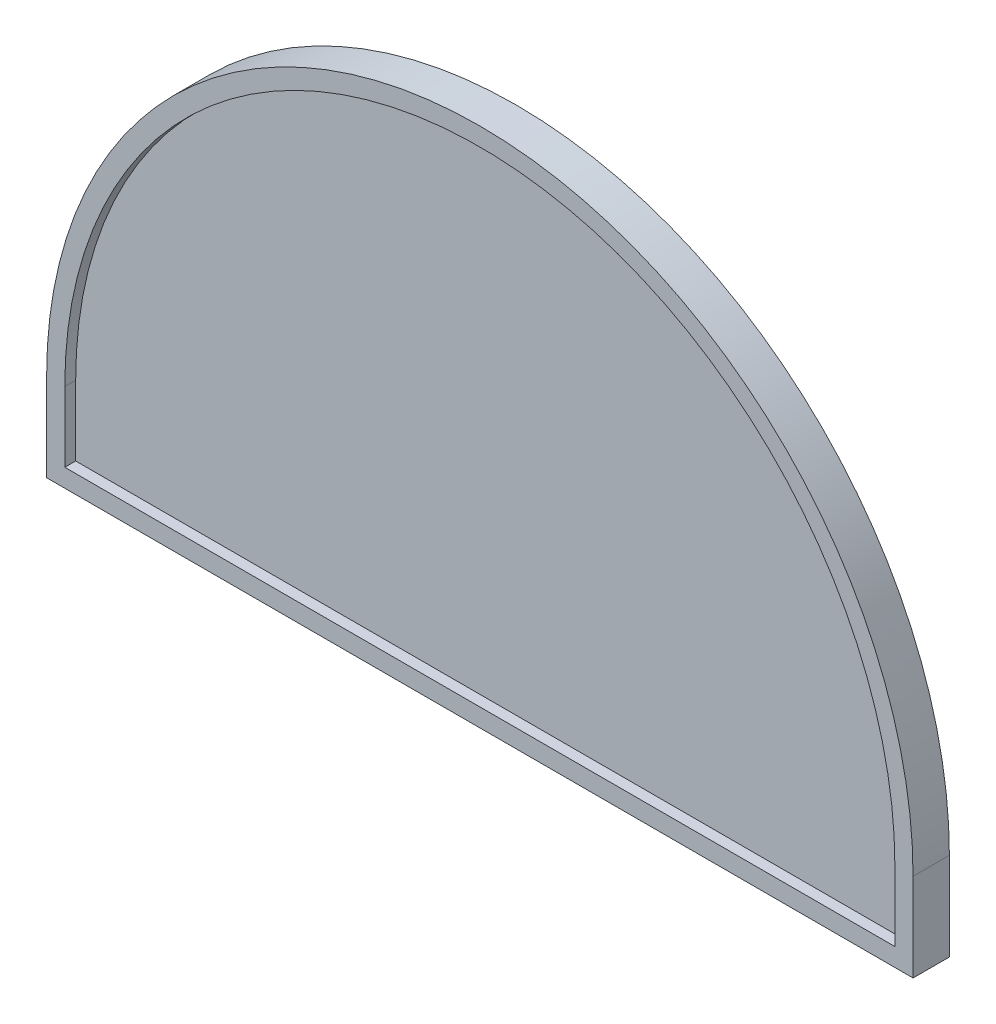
ISO-10303-21;
HEADER;
FILE_DESCRIPTION(('STEP AP214'),'2;1');
FILE_NAME('part.step','',(''),(''),'','','');
FILE_SCHEMA(('AUTOMOTIVE_DESIGN { 1 0 10303 214 1 1 1 1 }'));
ENDSEC;
DATA;
#1=APPLICATION_CONTEXT('core data for automotive mechanical design processes');
#2=APPLICATION_PROTOCOL_DEFINITION('international standard','automotive_design',2000,#1);
#3=PRODUCT_CONTEXT('',#1,'mechanical');
#4=PRODUCT('Part','Part','',(#3));
#5=PRODUCT_RELATED_PRODUCT_CATEGORY('part','',(#4));
#6=PRODUCT_DEFINITION_FORMATION('','',#4);
#7=PRODUCT_DEFINITION_CONTEXT('part definition',#1,'design');
#8=PRODUCT_DEFINITION('design','',#6,#7);
#9=PRODUCT_DEFINITION_SHAPE('','',#8);
#10=(LENGTH_UNIT() NAMED_UNIT(*) SI_UNIT(.MILLI.,.METRE.));
#11=(NAMED_UNIT(*) PLANE_ANGLE_UNIT() SI_UNIT($,.RADIAN.));
#12=(NAMED_UNIT(*) SI_UNIT($,.STERADIAN.) SOLID_ANGLE_UNIT());
#13=UNCERTAINTY_MEASURE_WITH_UNIT(LENGTH_MEASURE(1.E-05),#10,'distance_accuracy_value','');
#14=(GEOMETRIC_REPRESENTATION_CONTEXT(3) GLOBAL_UNCERTAINTY_ASSIGNED_CONTEXT((#13)) GLOBAL_UNIT_ASSIGNED_CONTEXT((#10,
#11,#12)) REPRESENTATION_CONTEXT('',''));
#15=CARTESIAN_POINT('',(0.,0.,0.));
#16=DIRECTION('',(0.,0.,1.));
#17=DIRECTION('',(1.,0.,0.));
#18=AXIS2_PLACEMENT_3D('',#15,#16,#17);
#19=CARTESIAN_POINT('',(0.,0.,2.8));
#20=DIRECTION('',(0.,0.,1.));
#21=DIRECTION('',(1.,0.,0.));
#22=AXIS2_PLACEMENT_3D('',#19,#20,#21);
#23=PLANE('',#22);
#24=DIRECTION('',(0.,-1.,0.));
#25=VECTOR('',#24,1.);
#26=CARTESIAN_POINT('',(45.7,0.,2.8));
#27=LINE('',#26,#25);
#28=CARTESIAN_POINT('',(45.7,0.,2.8));
#29=VERTEX_POINT('',#28);
#30=CARTESIAN_POINT('',(45.7,-7.70000000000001,2.8));
#31=VERTEX_POINT('',#30);
#32=EDGE_CURVE('E156',#29,#31,#27,.T.);
#33=ORIENTED_EDGE('',*,*,#32,.F.);
#34=CARTESIAN_POINT('',(0.,0.,2.8));
#35=DIRECTION('',(0.,0.,1.));
#36=DIRECTION('',(1.,0.,0.));
#37=AXIS2_PLACEMENT_3D('',#34,#35,#36);
#38=CIRCLE('',#37,45.7);
#39=CARTESIAN_POINT('',(-45.7,0.,2.8));
#40=VERTEX_POINT('',#39);
#41=EDGE_CURVE('E11',#29,#40,#38,.T.);
#42=ORIENTED_EDGE('',*,*,#41,.T.);
#43=DIRECTION('',(0.,-1.,0.));
#44=VECTOR('',#43,1.);
#45=CARTESIAN_POINT('',(-45.7,0.,2.8));
#46=LINE('',#45,#44);
#47=CARTESIAN_POINT('',(-45.7,-7.70000000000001,2.8));
#48=VERTEX_POINT('',#47);
#49=EDGE_CURVE('E41',#40,#48,#46,.T.);
#50=ORIENTED_EDGE('',*,*,#49,.T.);
#51=DIRECTION('',(-1.,0.,0.));
#52=VECTOR('',#51,1.);
#53=CARTESIAN_POINT('',(45.7,-7.70000000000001,2.8));
#54=LINE('',#53,#52);
#55=EDGE_CURVE('E56',#31,#48,#54,.T.);
#56=ORIENTED_EDGE('',*,*,#55,.F.);
#57=EDGE_LOOP('',(#33,#42,#50,#56));
#58=FACE_BOUND('',#57,.T.);
#59=ADVANCED_FACE('F33',(#58),#23,.T.);
#60=CARTESIAN_POINT('',(0.,0.,4.));
#61=DIRECTION('',(0.,0.,1.));
#62=DIRECTION('',(1.,0.,0.));
#63=AXIS2_PLACEMENT_3D('',#60,#61,#62);
#64=PLANE('',#63);
#65=CARTESIAN_POINT('',(0.,0.,4.));
#66=DIRECTION('',(0.,0.,1.));
#67=DIRECTION('',(1.,0.,0.));
#68=AXIS2_PLACEMENT_3D('',#65,#66,#67);
#69=CIRCLE('',#68,47.7);
#70=CARTESIAN_POINT('',(47.7,0.,4.));
#71=VERTEX_POINT('',#70);
#72=CARTESIAN_POINT('',(-47.7,0.,4.));
#73=VERTEX_POINT('',#72);
#74=EDGE_CURVE('E127',#71,#73,#69,.T.);
#75=ORIENTED_EDGE('',*,*,#74,.T.);
#76=DIRECTION('',(0.,-1.,0.));
#77=VECTOR('',#76,1.);
#78=CARTESIAN_POINT('',(-47.7,0.,4.));
#79=LINE('',#78,#77);
#80=CARTESIAN_POINT('',(-47.7,-9.70000000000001,4.));
#81=VERTEX_POINT('',#80);
#82=EDGE_CURVE('E130',#73,#81,#79,.T.);
#83=ORIENTED_EDGE('',*,*,#82,.T.);
#84=DIRECTION('',(1.,0.,0.));
#85=VECTOR('',#84,1.);
#86=CARTESIAN_POINT('',(47.7,-9.7,4.));
#87=LINE('',#86,#85);
#88=CARTESIAN_POINT('',(47.7,-9.7,4.));
#89=VERTEX_POINT('',#88);
#90=EDGE_CURVE('E133',#81,#89,#87,.T.);
#91=ORIENTED_EDGE('',*,*,#90,.T.);
#92=DIRECTION('',(0.,1.,0.));
#93=VECTOR('',#92,1.);
#94=CARTESIAN_POINT('',(47.7,0.,4.));
#95=LINE('',#94,#93);
#96=EDGE_CURVE('E135',#89,#71,#95,.T.);
#97=ORIENTED_EDGE('',*,*,#96,.T.);
#98=EDGE_LOOP('',(#75,#83,#91,#97));
#99=FACE_BOUND('',#98,.T.);
#100=DIRECTION('',(1.,0.,0.));
#101=VECTOR('',#100,1.);
#102=CARTESIAN_POINT('',(45.7,-7.70000000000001,4.));
#103=LINE('',#102,#101);
#104=CARTESIAN_POINT('',(-45.7,-7.70000000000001,4.));
#105=VERTEX_POINT('',#104);
#106=CARTESIAN_POINT('',(45.7,-7.70000000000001,4.));
#107=VERTEX_POINT('',#106);
#108=EDGE_CURVE('E106',#105,#107,#103,.T.);
#109=ORIENTED_EDGE('',*,*,#108,.F.);
#110=DIRECTION('',(0.,-1.,0.));
#111=VECTOR('',#110,1.);
#112=CARTESIAN_POINT('',(-45.7,0.,4.));
#113=LINE('',#112,#111);
#114=CARTESIAN_POINT('',(-45.7,0.,4.));
#115=VERTEX_POINT('',#114);
#116=EDGE_CURVE('E99',#115,#105,#113,.T.);
#117=ORIENTED_EDGE('',*,*,#116,.F.);
#118=CARTESIAN_POINT('',(0.,0.,4.));
#119=DIRECTION('',(0.,0.,1.));
#120=DIRECTION('',(1.,0.,0.));
#121=AXIS2_PLACEMENT_3D('',#118,#119,#120);
#122=CIRCLE('',#121,45.7);
#123=CARTESIAN_POINT('',(45.7,0.,4.));
#124=VERTEX_POINT('',#123);
#125=EDGE_CURVE('E118',#124,#115,#122,.T.);
#126=ORIENTED_EDGE('',*,*,#125,.F.);
#127=DIRECTION('',(0.,1.,0.));
#128=VECTOR('',#127,1.);
#129=CARTESIAN_POINT('',(45.7,0.,4.));
#130=LINE('',#129,#128);
#131=EDGE_CURVE('E116',#107,#124,#130,.T.);
#132=ORIENTED_EDGE('',*,*,#131,.F.);
#133=EDGE_LOOP('',(#109,#117,#126,#132));
#134=FACE_BOUND('',#133,.T.);
#135=ADVANCED_FACE('F114',(#99,#134),#64,.T.);
#136=CARTESIAN_POINT('',(0.,0.,4.));
#137=DIRECTION('',(0.,0.,-1.));
#138=DIRECTION('',(-1.,0.,0.));
#139=AXIS2_PLACEMENT_3D('',#136,#137,#138);
#140=CYLINDRICAL_SURFACE('',#139,47.7);
#141=CARTESIAN_POINT('',(0.,0.,0.));
#142=DIRECTION('',(0.,0.,1.));
#143=DIRECTION('',(1.,0.,0.));
#144=AXIS2_PLACEMENT_3D('',#141,#142,#143);
#145=CIRCLE('',#144,47.7);
#146=CARTESIAN_POINT('',(47.7,0.,0.));
#147=VERTEX_POINT('',#146);
#148=CARTESIAN_POINT('',(-47.7,0.,0.));
#149=VERTEX_POINT('',#148);
#150=EDGE_CURVE('E110',#147,#149,#145,.T.);
#151=ORIENTED_EDGE('',*,*,#150,.T.);
#152=DIRECTION('',(0.,0.,-1.));
#153=VECTOR('',#152,1.);
#154=CARTESIAN_POINT('',(-47.7,0.,4.));
#155=LINE('',#154,#153);
#156=EDGE_CURVE('E153',#73,#149,#155,.T.);
#157=ORIENTED_EDGE('',*,*,#156,.F.);
#158=ORIENTED_EDGE('',*,*,#74,.F.);
#159=DIRECTION('',(0.,0.,-1.));
#160=VECTOR('',#159,1.);
#161=CARTESIAN_POINT('',(47.7,0.,4.));
#162=LINE('',#161,#160);
#163=EDGE_CURVE('E137',#71,#147,#162,.T.);
#164=ORIENTED_EDGE('',*,*,#163,.T.);
#165=EDGE_LOOP('',(#151,#157,#158,#164));
#166=FACE_BOUND('',#165,.T.);
#167=ADVANCED_FACE('F175',(#166),#140,.T.);
#168=CARTESIAN_POINT('',(-47.7,0.,4.));
#169=DIRECTION('',(1.,0.,0.));
#170=DIRECTION('',(0.,0.,-1.));
#171=AXIS2_PLACEMENT_3D('',#168,#169,#170);
#172=PLANE('',#171);
#173=DIRECTION('',(0.,-1.,0.));
#174=VECTOR('',#173,1.);
#175=CARTESIAN_POINT('',(-47.7,0.,0.));
#176=LINE('',#175,#174);
#177=CARTESIAN_POINT('',(-47.7,-9.70000000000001,0.));
#178=VERTEX_POINT('',#177);
#179=EDGE_CURVE('E140',#149,#178,#176,.T.);
#180=ORIENTED_EDGE('',*,*,#179,.T.);
#181=DIRECTION('',(0.,0.,-1.));
#182=VECTOR('',#181,1.);
#183=CARTESIAN_POINT('',(-47.7,-9.70000000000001,4.));
#184=LINE('',#183,#182);
#185=EDGE_CURVE('E150',#81,#178,#184,.T.);
#186=ORIENTED_EDGE('',*,*,#185,.F.);
#187=ORIENTED_EDGE('',*,*,#82,.F.);
#188=ORIENTED_EDGE('',*,*,#156,.T.);
#189=EDGE_LOOP('',(#180,#186,#187,#188));
#190=FACE_BOUND('',#189,.T.);
#191=ADVANCED_FACE('F181',(#190),#172,.F.);
#192=CARTESIAN_POINT('',(47.7,-9.7,4.));
#193=DIRECTION('',(0.,1.,0.));
#194=DIRECTION('',(-1.,0.,0.));
#195=AXIS2_PLACEMENT_3D('',#192,#193,#194);
#196=PLANE('',#195);
#197=DIRECTION('',(1.,0.,0.));
#198=VECTOR('',#197,1.);
#199=CARTESIAN_POINT('',(47.7,-9.7,0.));
#200=LINE('',#199,#198);
#201=CARTESIAN_POINT('',(47.7,-9.7,0.));
#202=VERTEX_POINT('',#201);
#203=EDGE_CURVE('E142',#178,#202,#200,.T.);
#204=ORIENTED_EDGE('',*,*,#203,.T.);
#205=DIRECTION('',(0.,0.,-1.));
#206=VECTOR('',#205,1.);
#207=CARTESIAN_POINT('',(47.7,-9.7,4.));
#208=LINE('',#207,#206);
#209=EDGE_CURVE('E147',#89,#202,#208,.T.);
#210=ORIENTED_EDGE('',*,*,#209,.F.);
#211=ORIENTED_EDGE('',*,*,#90,.F.);
#212=ORIENTED_EDGE('',*,*,#185,.T.);
#213=EDGE_LOOP('',(#204,#210,#211,#212));
#214=FACE_BOUND('',#213,.T.);
#215=ADVANCED_FACE('F185',(#214),#196,.F.);
#216=CARTESIAN_POINT('',(47.7,0.,4.));
#217=DIRECTION('',(-1.,0.,0.));
#218=DIRECTION('',(0.,0.,1.));
#219=AXIS2_PLACEMENT_3D('',#216,#217,#218);
#220=PLANE('',#219);
#221=DIRECTION('',(0.,1.,0.));
#222=VECTOR('',#221,1.);
#223=CARTESIAN_POINT('',(47.7,0.,0.));
#224=LINE('',#223,#222);
#225=EDGE_CURVE('E131',#202,#147,#224,.T.);
#226=ORIENTED_EDGE('',*,*,#225,.T.);
#227=ORIENTED_EDGE('',*,*,#163,.F.);
#228=ORIENTED_EDGE('',*,*,#96,.F.);
#229=ORIENTED_EDGE('',*,*,#209,.T.);
#230=EDGE_LOOP('',(#226,#227,#228,#229));
#231=FACE_BOUND('',#230,.T.);
#232=ADVANCED_FACE('F189',(#231),#220,.F.);
#233=CARTESIAN_POINT('',(-45.7,0.,4.));
#234=DIRECTION('',(1.,0.,0.));
#235=DIRECTION('',(0.,0.,-1.));
#236=AXIS2_PLACEMENT_3D('',#233,#234,#235);
#237=PLANE('',#236);
#238=DIRECTION('',(0.,0.,-1.));
#239=VECTOR('',#238,1.);
#240=CARTESIAN_POINT('',(-45.7,-7.70000000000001,4.));
#241=LINE('',#240,#239);
#242=EDGE_CURVE('E101',#105,#48,#241,.T.);
#243=ORIENTED_EDGE('',*,*,#242,.T.);
#244=ORIENTED_EDGE('',*,*,#49,.F.);
#245=DIRECTION('',(0.,0.,-1.));
#246=VECTOR('',#245,1.);
#247=CARTESIAN_POINT('',(-45.7,0.,4.));
#248=LINE('',#247,#246);
#249=EDGE_CURVE('E48',#115,#40,#248,.T.);
#250=ORIENTED_EDGE('',*,*,#249,.F.);
#251=ORIENTED_EDGE('',*,*,#116,.T.);
#252=EDGE_LOOP('',(#243,#244,#250,#251));
#253=FACE_BOUND('',#252,.T.);
#254=ADVANCED_FACE('F100',(#253),#237,.T.);
#255=CARTESIAN_POINT('',(45.7,-7.70000000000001,4.));
#256=DIRECTION('',(0.,1.,0.));
#257=DIRECTION('',(0.,0.,1.));
#258=AXIS2_PLACEMENT_3D('',#255,#256,#257);
#259=PLANE('',#258);
#260=DIRECTION('',(0.,0.,-1.));
#261=VECTOR('',#260,1.);
#262=CARTESIAN_POINT('',(45.7,-7.70000000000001,4.));
#263=LINE('',#262,#261);
#264=EDGE_CURVE('E111',#107,#31,#263,.T.);
#265=ORIENTED_EDGE('',*,*,#264,.T.);
#266=ORIENTED_EDGE('',*,*,#55,.T.);
#267=ORIENTED_EDGE('',*,*,#242,.F.);
#268=ORIENTED_EDGE('',*,*,#108,.T.);
#269=EDGE_LOOP('',(#265,#266,#267,#268));
#270=FACE_BOUND('',#269,.T.);
#271=ADVANCED_FACE('F108',(#270),#259,.T.);
#272=CARTESIAN_POINT('',(45.7,0.,4.));
#273=DIRECTION('',(-1.,0.,0.));
#274=DIRECTION('',(0.,0.,1.));
#275=AXIS2_PLACEMENT_3D('',#272,#273,#274);
#276=PLANE('',#275);
#277=DIRECTION('',(0.,0.,-1.));
#278=VECTOR('',#277,1.);
#279=CARTESIAN_POINT('',(45.7,0.,4.));
#280=LINE('',#279,#278);
#281=EDGE_CURVE('E123',#124,#29,#280,.T.);
#282=ORIENTED_EDGE('',*,*,#281,.T.);
#283=ORIENTED_EDGE('',*,*,#32,.T.);
#284=ORIENTED_EDGE('',*,*,#264,.F.);
#285=ORIENTED_EDGE('',*,*,#131,.T.);
#286=EDGE_LOOP('',(#282,#283,#284,#285));
#287=FACE_BOUND('',#286,.T.);
#288=ADVANCED_FACE('F162',(#287),#276,.T.);
#289=CARTESIAN_POINT('',(0.,0.,4.));
#290=DIRECTION('',(0.,0.,-1.));
#291=DIRECTION('',(-1.,0.,0.));
#292=AXIS2_PLACEMENT_3D('',#289,#290,#291);
#293=CYLINDRICAL_SURFACE('',#292,45.7);
#294=ORIENTED_EDGE('',*,*,#249,.T.);
#295=ORIENTED_EDGE('',*,*,#41,.F.);
#296=ORIENTED_EDGE('',*,*,#281,.F.);
#297=ORIENTED_EDGE('',*,*,#125,.T.);
#298=EDGE_LOOP('',(#294,#295,#296,#297));
#299=FACE_BOUND('',#298,.T.);
#300=ADVANCED_FACE('F160',(#299),#293,.F.);
#301=CARTESIAN_POINT('',(0.,0.,0.));
#302=DIRECTION('',(0.,0.,1.));
#303=DIRECTION('',(1.,0.,0.));
#304=AXIS2_PLACEMENT_3D('',#301,#302,#303);
#305=PLANE('',#304);
#306=ORIENTED_EDGE('',*,*,#150,.F.);
#307=ORIENTED_EDGE('',*,*,#225,.F.);
#308=ORIENTED_EDGE('',*,*,#203,.F.);
#309=ORIENTED_EDGE('',*,*,#179,.F.);
#310=EDGE_LOOP('',(#306,#307,#308,#309));
#311=FACE_BOUND('',#310,.T.);
#312=ADVANCED_FACE('F35',(#311),#305,.F.);
#313=CLOSED_SHELL('',(#59,#135,#167,#191,#215,#232,#254,#271,#288,#300,#312));
#314=MANIFOLD_SOLID_BREP('B2',#313);
#315=ADVANCED_BREP_SHAPE_REPRESENTATION('',(#18,#314),#14);
#316=SHAPE_DEFINITION_REPRESENTATION(#9,#315);
ENDSEC;
END-ISO-10303-21;
